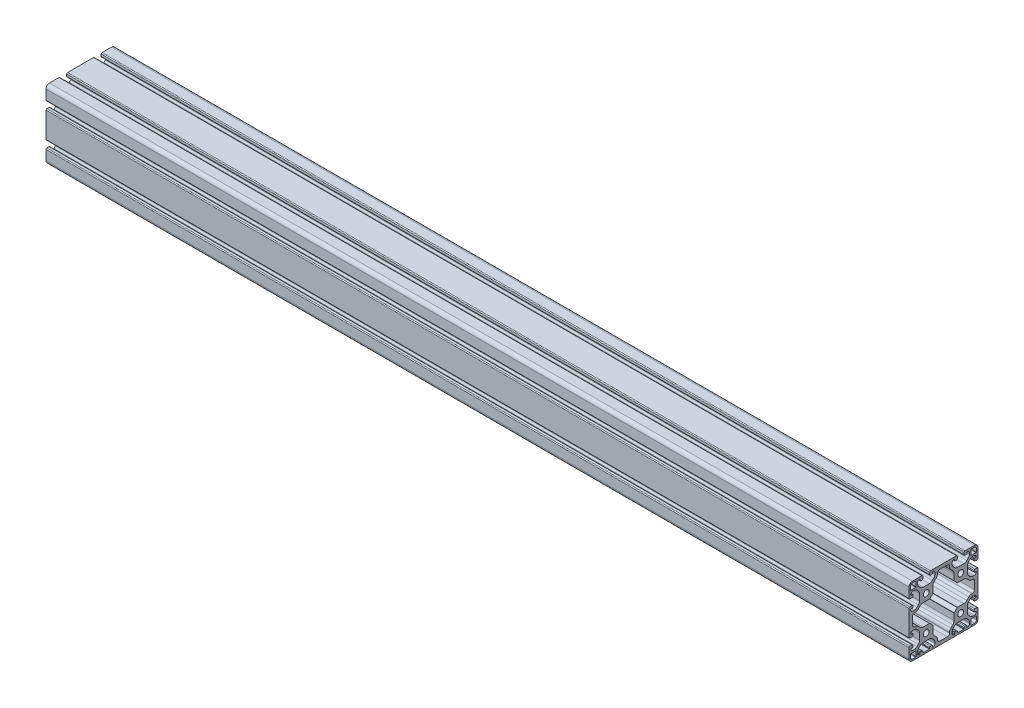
from build123d import *

# Parameters (mm, degrees)
SKIZZE14_R             = 3.4
STRUKTURBAUTEIL1_DEPTH = 1000


with BuildPart() as part:
    # Skizze14 → Strukturbauteil1 (new body)
    with BuildSketch(Plane(origin=(0, 0, 0), x_dir=(0, 0, -1), z_dir=(1, 0, 0))):
        with BuildLine():
            Line((-37.49999925, -23.673614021), (-38.99999925, -23.673614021))
            ThreePointArc((-38.99999925, -23.673614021), (-39.707106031, -23.96650724), (-39.99999925, -24.673614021))
            Line((-39.99999925, -24.673614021), (-39.99999925, -35.99999925))
            ThreePointArc((-39.99999925, -35.99999925), (-38.828426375, -38.828426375), (-35.99999925, -39.99999925))
            Line((-35.99999925, -39.99999925), (36.00000075, -39.99999925))
            ThreePointArc((36.00000075, -39.99999925), (38.828426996, -38.828424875), (39.99999925, -35.99999775))
            Line((39.99999925, -35.99999775), (39.99999925, -24.99999775))
            ThreePointArc((39.99999925, -24.99999775), (39.707106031, -24.292890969), (38.99999925, -23.99999775))
            Line((38.99999925, -23.99999775), (36.49999925, -23.99999775))
            ThreePointArc((36.49999925, -23.99999775), (35.792892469, -24.292890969), (35.49999925, -24.99999775))
            Line((35.49999925, -24.99999775), (35.49999925, -26.49999775))
            ThreePointArc((35.49999925, -26.49999775), (35.646445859, -26.853551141), (35.99999925, -26.99999775))
            Line((35.99999925, -26.99999775), (37.55000225, -26.99999775))
            ThreePointArc((37.55000225, -26.99999775), (37.868198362, -27.131800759), (37.99999925, -27.44999775))
            Line((37.99999925, -27.44999775), (37.99999925, -27.49999775))
            ThreePointArc((37.99999925, -27.49999775), (37.267766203, -29.267764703), (35.49999925, -29.99999775))
            Line((35.49999925, -29.99999775), (34.19238925, -29.99999775))
            ThreePointArc((34.19238925, -29.99999775), (32.278970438, -29.619396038), (30.65685225, -28.53553175))
            Line((30.65685225, -28.53553175), (29.21446125, -27.09314275))
            ThreePointArc((29.21446125, -27.09314275), (28.130599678, -25.471025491), (27.74999925, -23.55760875))
            Line((27.74999925, -23.55760875), (27.74999925, -16.44238675))
            ThreePointArc((27.74999925, -16.44238675), (28.130603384, -14.528969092), (29.21446925, -12.90685275))
            Line((29.21446925, -12.90685275), (30.65685225, -11.46446375))
            ThreePointArc((30.65685225, -11.46446375), (32.278970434, -10.380599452), (34.19238925, -9.99999775))
            Line((34.19238925, -9.99999775), (35.49999925, -9.99999775))
            ThreePointArc((35.49999925, -9.99999775), (37.267766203, -10.732230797), (37.99999925, -12.49999775))
            Line((37.99999925, -12.49999775), (37.99999925, -12.54999675))
            ThreePointArc((37.99999925, -12.54999675), (37.868198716, -12.868194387), (37.55000225, -12.99999775))
            Line((37.55000225, -12.99999775), (35.99999925, -12.99999775))
            ThreePointArc((35.99999925, -12.99999775), (35.646445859, -13.146444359), (35.49999925, -13.49999775))
            Line((35.49999925, -13.49999775), (35.49999925, -14.99999775))
            ThreePointArc((35.49999925, -14.99999775), (35.792892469, -15.707104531), (36.49999925, -15.99999775))
            Line((36.49999925, -15.99999775), (38.99999925, -15.99999775))
            ThreePointArc((38.99999925, -15.99999775), (39.707106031, -15.707104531), (39.99999925, -14.99999775))
            Line((39.99999925, -14.99999775), (39.99999925, 15.00000225))
            ThreePointArc((39.99999925, 15.00000225), (39.707106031, 15.707109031), (38.99999925, 16.00000225))
            Line((38.99999925, 16.00000225), (36.49999925, 16.00000225))
            ThreePointArc((36.49999925, 16.00000225), (35.792892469, 15.707109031), (35.49999925, 15.00000225))
            Line((35.49999925, 15.00000225), (35.49999925, 13.50000225))
            ThreePointArc((35.49999925, 13.50000225), (35.646445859, 13.146448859), (35.99999925, 13.00000225))
            Line((35.99999925, 13.00000225), (37.55000225, 13.00000225))
            ThreePointArc((37.55000225, 13.00000225), (37.868198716, 12.868198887), (37.99999925, 12.55000125))
            Line((37.99999925, 12.55000125), (37.99999925, 12.50000225))
            ThreePointArc((37.99999925, 12.50000225), (37.267766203, 10.732235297), (35.49999925, 10.00000225))
            Line((35.49999925, 10.00000225), (34.19238925, 10.00000225))
            ThreePointArc((34.19238925, 10.00000225), (32.278970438, 10.380603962), (30.65685225, 11.46446825))
            Line((30.65685225, 11.46446825), (29.21446125, 12.90685525))
            ThreePointArc((29.21446125, 12.90685525), (28.130599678, 14.528972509), (27.74999925, 16.44238925))
            Line((27.74999925, 16.44238925), (27.74999925, 23.55761525))
            ThreePointArc((27.74999925, 23.55761525), (28.130603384, 25.471032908), (29.21446925, 27.09314925))
            Line((29.21446925, 27.09314925), (30.65685225, 28.53554025))
            ThreePointArc((30.65685225, 28.53554025), (32.278970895, 29.619402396), (34.19238925, 30.00000225))
            Line((34.19238925, 30.00000225), (35.49999925, 30.00000225))
            ThreePointArc((35.49999925, 30.00000225), (37.267766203, 29.267769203), (37.99999925, 27.50000225))
            Line((37.99999925, 27.50000225), (37.99999925, 27.44999925))
            ThreePointArc((37.99999925, 27.44999925), (37.868197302, 27.131804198), (37.55000225, 27.00000225))
            Line((37.55000225, 27.00000225), (35.99999925, 27.00000225))
            ThreePointArc((35.99999925, 27.00000225), (35.646445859, 26.853555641), (35.49999925, 26.50000225))
            Line((35.49999925, 26.50000225), (35.49999925, 25.00000225))
            ThreePointArc((35.49999925, 25.00000225), (35.792892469, 24.292895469), (36.49999925, 24.00000225))
            Line((36.49999925, 24.00000225), (38.99999925, 24.00000225))
            ThreePointArc((38.99999925, 24.00000225), (39.70710691, 24.292893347), (40.00000225, 24.99999925))
            Line((40.00000225, 24.99999925), (40.00000225, 35.99999925))
            ThreePointArc((40.00000225, 35.99999925), (38.828428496, 38.828425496), (36.00000225, 39.99999925))
            Line((36.00000225, 39.99999925), (25.00000225, 39.99999925))
            ThreePointArc((25.00000225, 39.99999925), (24.292895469, 39.707106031), (24.00000225, 38.99999925))
            Line((24.00000225, 38.99999925), (24.00000225, 36.49999925))
            ThreePointArc((24.00000225, 36.49999925), (24.292895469, 35.792892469), (25.00000225, 35.49999925))
            Line((25.00000225, 35.49999925), (26.50000225, 35.49999925))
            ThreePointArc((26.50000225, 35.49999925), (26.853555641, 35.646445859), (27.00000225, 35.99999925))
            Line((27.00000225, 35.99999925), (27.00000225, 37.55000225))
            ThreePointArc((27.00000225, 37.55000225), (27.131804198, 37.868197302), (27.44999925, 37.99999925))
            Line((27.44999925, 37.99999925), (27.50000225, 37.99999925))
            ThreePointArc((27.50000225, 37.99999925), (29.267769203, 37.267766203), (30.00000225, 35.49999925))
            Line((30.00000225, 35.49999925), (30.00000225, 34.19238925))
            ThreePointArc((30.00000225, 34.19238925), (29.619402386, 32.278970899), (28.53554025, 30.65685225))
            Line((28.53554025, 30.65685225), (27.09314925, 29.21446125))
            ThreePointArc((27.09314925, 29.21446125), (25.471031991, 28.130599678), (23.55761525, 27.74999925))
            Line((23.55761525, 27.74999925), (16.44238925, 27.74999925))
            ThreePointArc((16.44238925, 27.74999925), (14.528971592, 28.130603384), (12.90685525, 29.21446925))
            Line((12.90685525, 29.21446925), (11.46446825, 30.65685225))
            ThreePointArc((11.46446825, 30.65685225), (10.380603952, 32.278970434), (10.00000225, 34.19238925))
            Line((10.00000225, 34.19238925), (10.00000225, 35.49999925))
            ThreePointArc((10.00000225, 35.49999925), (10.732235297, 37.267766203), (12.50000225, 37.99999925))
            Line((12.50000225, 37.99999925), (12.55000125, 37.99999925))
            ThreePointArc((12.55000125, 37.99999925), (12.868198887, 37.868198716), (13.00000225, 37.55000225))
            Line((13.00000225, 37.55000225), (13.00000225, 35.99999925))
            ThreePointArc((13.00000225, 35.99999925), (13.146448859, 35.646445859), (13.50000225, 35.49999925))
            Line((13.50000225, 35.49999925), (15.00000225, 35.49999925))
            ThreePointArc((15.00000225, 35.49999925), (15.707109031, 35.792892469), (16.00000225, 36.49999925))
            Line((16.00000225, 36.49999925), (16.00000225, 38.99999925))
            ThreePointArc((16.00000225, 38.99999925), (15.707109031, 39.707106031), (15.00000225, 39.99999925))
            Line((15.00000225, 39.99999925), (-14.99999775, 39.99999925))
            ThreePointArc((-14.99999775, 39.99999925), (-15.707104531, 39.707106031), (-15.99999775, 38.99999925))
            Line((-15.99999775, 38.99999925), (-15.99999775, 36.49999925))
            ThreePointArc((-15.99999775, 36.49999925), (-15.707104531, 35.792892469), (-14.99999775, 35.49999925))
            Line((-14.99999775, 35.49999925), (-13.49999775, 35.49999925))
            ThreePointArc((-13.49999775, 35.49999925), (-13.146444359, 35.646445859), (-12.99999775, 35.99999925))
            Line((-12.99999775, 35.99999925), (-12.99999775, 37.55000225))
            ThreePointArc((-12.99999775, 37.55000225), (-12.868194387, 37.868198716), (-12.54999675, 37.99999925))
            Line((-12.54999675, 37.99999925), (-12.49999775, 37.99999925))
            ThreePointArc((-12.49999775, 37.99999925), (-10.732230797, 37.267766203), (-9.99999775, 35.49999925))
            Line((-9.99999775, 35.49999925), (-9.99999775, 34.19238925))
            ThreePointArc((-9.99999775, 34.19238925), (-10.380599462, 32.278970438), (-11.46446375, 30.65685225))
            Line((-11.46446375, 30.65685225), (-12.90685275, 29.21446125))
            ThreePointArc((-12.90685275, 29.21446125), (-14.528970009, 28.130599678), (-16.44238675, 27.74999925))
            Line((-16.44238675, 27.74999925), (-23.55760875, 27.74999925))
            ThreePointArc((-23.55760875, 27.74999925), (-25.471026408, 28.130603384), (-27.09314275, 29.21446925))
            Line((-27.09314275, 29.21446925), (-28.53553175, 30.65685225))
            ThreePointArc((-28.53553175, 30.65685225), (-29.619396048, 32.278970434), (-29.99999775, 34.19238925))
            Line((-29.99999775, 34.19238925), (-29.99999775, 35.49999925))
            ThreePointArc((-29.99999775, 35.49999925), (-29.267764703, 37.267766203), (-27.49999775, 37.99999925))
            Line((-27.49999775, 37.99999925), (-27.44999775, 37.99999925))
            ThreePointArc((-27.44999775, 37.99999925), (-27.131800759, 37.868198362), (-26.99999775, 37.55000225))
            Line((-26.99999775, 37.55000225), (-26.99999775, 35.99999925))
            ThreePointArc((-26.99999775, 35.99999925), (-26.853551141, 35.646445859), (-26.49999775, 35.49999925))
            Line((-26.49999775, 35.49999925), (-24.99999775, 35.49999925))
            ThreePointArc((-24.99999775, 35.49999925), (-24.292890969, 35.792892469), (-23.99999775, 36.49999925))
            Line((-23.99999775, 36.49999925), (-23.99999775, 38.99999925))
            ThreePointArc((-23.99999775, 38.99999925), (-24.292890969, 39.707106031), (-24.99999775, 39.99999925))
            Line((-24.99999775, 39.99999925), (-35.99999775, 39.99999925))
            ThreePointArc((-35.99999775, 39.99999925), (-38.828424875, 38.828426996), (-39.99999925, 36.00000075))
            Line((-39.99999925, 36.00000075), (-39.99999925, 24.765242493))
            ThreePointArc((-39.99999925, 24.765242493), (-39.707106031, 24.058135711), (-38.99999925, 23.765242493))
            Line((-38.99999925, 23.765242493), (-37.49999925, 23.765242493))
            Line((-37.49999925, 23.765242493), (-36.49999925, 23.765242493))
            ThreePointArc((-36.49999925, 23.765242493), (-35.792892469, 24.058135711), (-35.49999925, 24.765242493))
            Line((-35.49999925, 24.765242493), (-35.49999925, 26.265242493))
            ThreePointArc((-35.49999925, 26.265242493), (-35.646445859, 26.618795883), (-35.99999925, 26.765242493))
            Line((-35.99999925, 26.765242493), (-37.49999925, 26.765242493))
            ThreePointArc((-37.49999925, 26.765242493), (-37.853552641, 26.911689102), (-37.99999925, 27.265242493))
            ThreePointArc((-37.99999925, 27.265242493), (-37.267766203, 29.033009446), (-35.49999925, 29.765242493))
            Line((-35.49999925, 29.765242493), (-34.19238725, 29.765242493))
            ThreePointArc((-34.19238725, 29.765242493), (-32.278971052, 29.384641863), (-30.65685425, 28.300780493))
            Line((-30.65685425, 28.300780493), (-29.21446525, 26.858389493))
            ThreePointArc((-29.21446525, 26.858389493), (-28.130601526, 25.236272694), (-27.74999925, 23.322855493))
            Line((-27.74999925, 23.322855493), (-27.74999925, 16.207629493))
            ThreePointArc((-27.74999925, 16.207629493), (-28.130601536, 14.294212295), (-29.21446525, 12.672095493))
            Line((-29.21446525, 12.672095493), (-30.65685425, 11.229708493))
            ThreePointArc((-30.65685425, 11.229708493), (-32.278970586, 10.14584496), (-34.19238725, 9.765242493))
            Line((-34.19238725, 9.765242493), (-35.49999925, 9.765242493))
            ThreePointArc((-35.49999925, 9.765242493), (-37.267766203, 10.49747554), (-37.99999925, 12.265242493))
            ThreePointArc((-37.99999925, 12.265242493), (-37.853552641, 12.618795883), (-37.49999925, 12.765242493))
            Line((-37.49999925, 12.765242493), (-35.99999925, 12.765242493))
            ThreePointArc((-35.99999925, 12.765242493), (-35.646445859, 12.911689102), (-35.49999925, 13.265242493))
            Line((-35.49999925, 13.265242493), (-35.49999925, 14.765242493))
            ThreePointArc((-35.49999925, 14.765242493), (-35.792892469, 15.472349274), (-36.49999925, 15.765242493))
            Line((-36.49999925, 15.765242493), (-37.49999925, 15.765242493))
            Line((-37.49999925, 15.765242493), (-38.99999925, 15.765242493))
            ThreePointArc((-38.99999925, 15.765242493), (-39.707106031, 15.472349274), (-39.99999925, 14.765242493))
            Line((-39.99999925, 14.765242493), (-39.99999925, -14.673614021))
            ThreePointArc((-39.99999925, -14.673614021), (-39.707106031, -15.380720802), (-38.99999925, -15.673614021))
            Line((-38.99999925, -15.673614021), (-37.49999925, -15.673614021))
            Line((-37.49999925, -15.673614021), (-36.49999925, -15.673614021))
            ThreePointArc((-36.49999925, -15.673614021), (-35.792892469, -15.380720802), (-35.49999925, -14.673614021))
            Line((-35.49999925, -14.673614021), (-35.49999925, -13.173614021))
            ThreePointArc((-35.49999925, -13.173614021), (-35.646445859, -12.820060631), (-35.99999925, -12.673614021))
            Line((-35.99999925, -12.673614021), (-37.49999925, -12.673614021))
            ThreePointArc((-37.49999925, -12.673614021), (-37.853552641, -12.527167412), (-37.99999925, -12.173614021))
            ThreePointArc((-37.99999925, -12.173614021), (-37.267766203, -10.405847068), (-35.49999925, -9.673614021))
            Line((-35.49999925, -9.673614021), (-34.19238725, -9.673614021))
            ThreePointArc((-34.19238725, -9.673614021), (-32.278970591, -10.054216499), (-30.65685425, -11.138080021))
            Line((-30.65685425, -11.138080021), (-29.21446525, -12.580469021))
            ThreePointArc((-29.21446525, -12.580469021), (-28.130601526, -14.20258582), (-27.74999925, -16.116003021))
            Line((-27.74999925, -16.116003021), (-27.74999925, -23.231225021))
            ThreePointArc((-27.74999925, -23.231225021), (-28.130601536, -25.144642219), (-29.21446525, -26.766759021))
            Line((-29.21446525, -26.766759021), (-30.65685425, -28.209148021))
            ThreePointArc((-30.65685425, -28.209148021), (-32.278970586, -29.293011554), (-34.19238725, -29.673614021))
            Line((-34.19238725, -29.673614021), (-35.49999925, -29.673614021))
            ThreePointArc((-35.49999925, -29.673614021), (-37.267766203, -28.941380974), (-37.99999925, -27.173614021))
            ThreePointArc((-37.99999925, -27.173614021), (-37.853552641, -26.820060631), (-37.49999925, -26.673614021))
            Line((-37.49999925, -26.673614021), (-35.99999925, -26.673614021))
            ThreePointArc((-35.99999925, -26.673614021), (-35.646445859, -26.527167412), (-35.49999925, -26.173614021))
            Line((-35.49999925, -26.173614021), (-35.49999925, -24.673614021))
            ThreePointArc((-35.49999925, -24.673614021), (-35.792892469, -23.96650724), (-36.49999925, -23.673614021))
            Line((-36.49999925, -23.673614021), (-37.49999925, -23.673614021))
        make_face()
        with Locations((20.00000075, 20.00000075)):
            Circle(SKIZZE14_R, mode=Mode.SUBTRACT)
        with Locations((-19.99999925, 20.00000075)):
            Circle(SKIZZE14_R, mode=Mode.SUBTRACT)
        with Locations((-19.99999925, -19.99999925)):
            Circle(SKIZZE14_R, mode=Mode.SUBTRACT)
        with Locations((20.00000075, -19.99999925)):
            Circle(SKIZZE14_R, mode=Mode.SUBTRACT)
        with BuildLine():
            Line((-38.19999775, 36.00000075), (-38.19999775, 32.30000375))
            ThreePointArc((-38.19999775, 32.30000375), (-38.053551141, 31.946450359), (-37.69999775, 31.80000375))
            Line((-37.69999775, 31.80000375), (-32.29999775, 31.80000375))
            ThreePointArc((-32.29999775, 31.80000375), (-31.946444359, 31.946450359), (-31.79999775, 32.30000375))
            Line((-31.79999775, 32.30000375), (-31.79999775, 37.69999775))
            ThreePointArc((-31.79999775, 37.69999775), (-31.946444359, 38.053551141), (-32.29999775, 38.19999775))
            Line((-32.29999775, 38.19999775), (-35.99999775, 38.19999775))
            ThreePointArc((-35.99999775, 38.19999775), (-37.555631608, 37.555633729), (-38.19999775, 36.00000075))
        make_face(mode=Mode.SUBTRACT)
        with BuildLine():
            Line((-32.94974725, 7.00000075), (-33.49999925, 7.00000075))
            ThreePointArc((-33.49999925, 7.00000075), (-35.267766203, 6.267767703), (-35.99999925, 4.50000075))
            Line((-35.99999925, 4.50000075), (-35.99999925, -4.49999925))
            ThreePointArc((-35.99999925, -4.49999925), (-35.266966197, -6.266966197), (-33.49999925, -6.99999925))
            Line((-33.49999925, -6.99999925), (-32.94974725, -6.99999925))
            ThreePointArc((-32.94974725, -6.99999925), (-31.036329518, -7.380601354), (-29.41421225, -8.46446525))
            Line((-29.41421225, -8.46446525), (-27.09314425, -10.78553325))
            ThreePointArc((-27.09314425, -10.78553325), (-25.471027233, -11.869396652), (-23.557609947, -12.249998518))
            Line((-23.557609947, -12.249998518), (-16.241377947, -12.249998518))
            ThreePointArc((-16.241377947, -12.249998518), (-16.050035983, -12.288058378), (-15.887823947, -12.396444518))
            Line((-15.887823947, -12.396444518), (-12.396444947, -15.887823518))
            ThreePointArc((-12.396444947, -15.887823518), (-12.288058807, -16.050035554), (-12.249998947, -16.241377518))
            Line((-12.249998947, -16.241377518), (-12.249998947, -23.557609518))
            ThreePointArc((-12.249998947, -23.557609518), (-11.869396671, -25.471026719), (-10.785532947, -27.093143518))
            Line((-10.785532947, -27.093143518), (-8.464464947, -29.414211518))
            ThreePointArc((-8.464464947, -29.414211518), (-7.380601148, -31.036328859), (-6.999999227, -32.949746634))
            Line((-6.999999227, -32.949746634), (-6.999999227, -33.499998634))
            ThreePointArc((-6.999999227, -33.499998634), (-6.26776618, -35.267765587), (-4.499999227, -35.999998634))
            Line((-4.499999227, -35.999998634), (4.500000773, -35.999998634))
            ThreePointArc((4.500000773, -35.999998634), (6.267767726, -35.267765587), (7.000000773, -33.499998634))
            Line((7.000000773, -33.499998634), (7.000000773, -32.949746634))
            ThreePointArc((7.000000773, -32.949746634), (7.380602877, -31.036328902), (8.464466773, -29.414211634))
            Line((8.464466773, -29.414211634), (10.785534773, -27.093143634))
            ThreePointArc((10.785534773, -27.093143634), (11.869398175, -25.471026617), (12.250000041, -23.557609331))
            Line((12.250000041, -23.557609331), (12.250000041, -16.241377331))
            ThreePointArc((12.250000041, -16.241377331), (12.288059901, -16.050035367), (12.396446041, -15.887823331))
            Line((12.396446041, -15.887823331), (15.887825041, -12.396444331))
            ThreePointArc((15.887825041, -12.396444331), (16.050037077, -12.288058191), (16.241379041, -12.249998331))
            Line((16.241379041, -12.249998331), (23.557613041, -12.249998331))
            ThreePointArc((23.557613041, -12.249998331), (25.471030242, -11.869396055), (27.093147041, -10.785532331))
            Line((27.093147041, -10.785532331), (29.414215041, -8.464464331))
            ThreePointArc((29.414215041, -8.464464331), (31.03633042, -7.380601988), (32.949745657, -6.999999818))
            Line((32.949745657, -6.999999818), (33.500000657, -6.999999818))
            ThreePointArc((33.500000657, -6.999999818), (35.26776761, -6.267766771), (36.000000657, -4.499999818))
            Line((36.000000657, -4.499999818), (36.000000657, 4.500000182))
            ThreePointArc((36.000000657, 4.500000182), (35.267766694, 6.267766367), (33.49999975, 6.999998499))
            Line((33.49999975, 6.999998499), (32.94974475, 6.999998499))
            ThreePointArc((32.94974475, 6.999998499), (31.036329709, 7.380601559), (29.41421475, 8.464464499))
            Line((29.41421475, 8.464464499), (27.09314675, 10.785532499))
            ThreePointArc((27.09314675, 10.785532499), (25.471030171, 11.86939634), (23.557613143, 12.249998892))
            Line((23.557613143, 12.249998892), (16.241379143, 12.249998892))
            ThreePointArc((16.241379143, 12.249998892), (16.05003718, 12.288058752), (15.887825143, 12.396444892))
            Line((15.887825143, 12.396444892), (12.396446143, 15.887823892))
            ThreePointArc((12.396446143, 15.887823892), (12.288060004, 16.050035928), (12.250000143, 16.241377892))
            Line((12.250000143, 16.241377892), (12.250000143, 23.557611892))
            ThreePointArc((12.250000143, 23.557611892), (11.869397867, 25.471029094), (10.785534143, 27.093145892))
            Line((10.785534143, 27.093145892), (8.464466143, 29.414213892))
            ThreePointArc((8.464466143, 29.414213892), (7.380603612, 31.036329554), (7.000001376, 32.949745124))
            Line((7.000001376, 32.949745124), (7.000001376, 33.500000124))
            ThreePointArc((7.000001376, 33.500000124), (6.267768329, 35.267767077), (4.500001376, 36.000000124))
            Line((4.500001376, 36.000000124), (-4.499998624, 36.000000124))
            ThreePointArc((-4.499998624, 36.000000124), (-6.267765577, 35.267767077), (-6.999998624, 33.500000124))
            Line((-6.999998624, 33.500000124), (-6.999998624, 32.949745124))
            ThreePointArc((-6.999998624, 32.949745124), (-7.380601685, 31.036330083), (-8.464464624, 29.414215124))
            Line((-8.464464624, 29.414215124), (-10.785532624, 27.093147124))
            ThreePointArc((-10.785532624, 27.093147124), (-11.869396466, 25.471030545), (-12.249999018, 23.557613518))
            Line((-12.249999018, 23.557613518), (-12.249999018, 16.241379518))
            ThreePointArc((-12.249999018, 16.241379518), (-12.288058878, 16.050037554), (-12.396445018, 15.887825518))
            Line((-12.396445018, 15.887825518), (-15.887824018, 12.396446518))
            ThreePointArc((-15.887824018, 12.396446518), (-16.050036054, 12.288060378), (-16.241378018, 12.250000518))
            Line((-16.241378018, 12.250000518), (-23.557610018, 12.250000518))
            ThreePointArc((-23.557610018, 12.250000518), (-25.471027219, 11.869398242), (-27.093144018, 10.785534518))
            Line((-27.093144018, 10.785534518), (-29.414212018, 8.464466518))
            ThreePointArc((-29.414212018, 8.464466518), (-31.036329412, 7.380602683), (-32.94974725, 7.00000075))
        make_face(mode=Mode.SUBTRACT)
        with BuildLine():
            Line((-32.29999925, -31.79999925), (-37.69999925, -31.79999925))
            ThreePointArc((-37.69999925, -31.79999925), (-38.053552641, -31.946445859), (-38.19999925, -32.29999925))
            Line((-38.19999925, -32.29999925), (-38.19999925, -35.99999925))
            ThreePointArc((-38.19999925, -35.99999925), (-37.555634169, -37.555634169), (-35.99999925, -38.19999925))
            Line((-35.99999925, -38.19999925), (-32.29999925, -38.19999925))
            ThreePointArc((-32.29999925, -38.19999925), (-31.946445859, -38.053552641), (-31.79999925, -37.69999925))
            Line((-31.79999925, -37.69999925), (-31.79999925, -32.29999925))
            ThreePointArc((-31.79999925, -32.29999925), (-31.946445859, -31.946445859), (-32.29999925, -31.79999925))
        make_face(mode=Mode.SUBTRACT)
        with BuildLine():
            Line((31.80000375, -32.29999775), (31.80000375, -37.69999775))
            ThreePointArc((31.80000375, -37.69999775), (31.946450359, -38.053551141), (32.30000375, -38.19999775))
            Line((32.30000375, -38.19999775), (36.00000075, -38.19999775))
            ThreePointArc((36.00000075, -38.19999775), (37.555633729, -37.555631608), (38.19999775, -35.99999775))
            Line((38.19999775, -35.99999775), (38.19999775, -32.29999775))
            ThreePointArc((38.19999775, -32.29999775), (38.053551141, -31.946444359), (37.69999775, -31.79999775))
            Line((37.69999775, -31.79999775), (32.30000375, -31.79999775))
            ThreePointArc((32.30000375, -31.79999775), (31.946450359, -31.946444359), (31.80000375, -32.29999775))
        make_face(mode=Mode.SUBTRACT)
        with BuildLine():
            Line((10.00000075, -34.19238725), (10.00000075, -35.49999925))
            ThreePointArc((10.00000075, -35.49999925), (10.732233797, -37.267766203), (12.50000075, -37.99999925))
            ThreePointArc((12.50000075, -37.99999925), (12.853554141, -37.853552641), (13.00000075, -37.49999925))
            Line((13.00000075, -37.49999925), (13.00000075, -35.99999925))
            ThreePointArc((13.00000075, -35.99999925), (13.146447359, -35.646445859), (13.50000075, -35.49999925))
            Line((13.50000075, -35.49999925), (15.00000075, -35.49999925))
            ThreePointArc((15.00000075, -35.49999925), (15.707107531, -35.792892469), (16.00000075, -36.49999925))
            Line((16.00000075, -36.49999925), (16.00000075, -37.49999925))
            ThreePointArc((16.00000075, -37.49999925), (16.146447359, -37.853552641), (16.50000075, -37.99999925))
            Line((16.50000075, -37.99999925), (23.50000075, -37.99999925))
            ThreePointArc((23.50000075, -37.99999925), (23.853554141, -37.853552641), (24.00000075, -37.49999925))
            Line((24.00000075, -37.49999925), (24.00000075, -36.49999925))
            ThreePointArc((24.00000075, -36.49999925), (24.292893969, -35.792892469), (25.00000075, -35.49999925))
            Line((25.00000075, -35.49999925), (26.50000075, -35.49999925))
            ThreePointArc((26.50000075, -35.49999925), (26.853554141, -35.646445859), (27.00000075, -35.99999925))
            Line((27.00000075, -35.99999925), (27.00000075, -37.49999925))
            ThreePointArc((27.00000075, -37.49999925), (27.146447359, -37.853552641), (27.50000075, -37.99999925))
            ThreePointArc((27.50000075, -37.99999925), (29.267767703, -37.267766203), (30.00000075, -35.49999925))
            Line((30.00000075, -35.49999925), (30.00000075, -34.19238725))
            ThreePointArc((30.00000075, -34.19238725), (29.61940013, -32.278971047), (28.53553875, -30.65685425))
            Line((28.53553875, -30.65685425), (27.09314775, -29.21446525))
            ThreePointArc((27.09314775, -29.21446525), (25.471030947, -28.130601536), (23.55761375, -27.74999925))
            Line((23.55761375, -27.74999925), (16.44238775, -27.74999925))
            ThreePointArc((16.44238775, -27.74999925), (14.528970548, -28.130601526), (12.90685375, -29.21446525))
            Line((12.90685375, -29.21446525), (11.46446675, -30.65685425))
            ThreePointArc((11.46446675, -30.65685425), (10.380603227, -32.278970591), (10.00000075, -34.19238725))
        make_face(mode=Mode.SUBTRACT)
        with BuildLine():
            Line((-29.99999925, -34.19238725), (-29.99999925, -35.49999925))
            ThreePointArc((-29.99999925, -35.49999925), (-29.267766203, -37.267766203), (-27.49999925, -37.99999925))
            ThreePointArc((-27.49999925, -37.99999925), (-27.146445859, -37.853552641), (-26.99999925, -37.49999925))
            Line((-26.99999925, -37.49999925), (-26.99999925, -35.99999925))
            ThreePointArc((-26.99999925, -35.99999925), (-26.853552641, -35.646445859), (-26.49999925, -35.49999925))
            Line((-26.49999925, -35.49999925), (-24.99999925, -35.49999925))
            ThreePointArc((-24.99999925, -35.49999925), (-24.292892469, -35.792892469), (-23.99999925, -36.49999925))
            Line((-23.99999925, -36.49999925), (-23.99999925, -37.49999925))
            ThreePointArc((-23.99999925, -37.49999925), (-23.853552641, -37.853552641), (-23.49999925, -37.99999925))
            Line((-23.49999925, -37.99999925), (-16.49999925, -37.99999925))
            ThreePointArc((-16.49999925, -37.99999925), (-16.146445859, -37.853552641), (-15.99999925, -37.49999925))
            Line((-15.99999925, -37.49999925), (-15.99999925, -36.49999925))
            ThreePointArc((-15.99999925, -36.49999925), (-15.707106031, -35.792892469), (-14.99999925, -35.49999925))
            Line((-14.99999925, -35.49999925), (-13.49999925, -35.49999925))
            ThreePointArc((-13.49999925, -35.49999925), (-13.146445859, -35.646445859), (-12.99999925, -35.99999925))
            Line((-12.99999925, -35.99999925), (-12.99999925, -37.49999925))
            ThreePointArc((-12.99999925, -37.49999925), (-12.853552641, -37.853552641), (-12.49999925, -37.99999925))
            ThreePointArc((-12.49999925, -37.99999925), (-10.732232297, -37.267766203), (-9.99999925, -35.49999925))
            Line((-9.99999925, -35.49999925), (-9.99999925, -34.19238725))
            ThreePointArc((-9.99999925, -34.19238725), (-10.380601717, -32.278970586), (-11.46446525, -30.65685425))
            Line((-11.46446525, -30.65685425), (-12.90685425, -29.21446525))
            ThreePointArc((-12.90685425, -29.21446525), (-14.528971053, -28.130601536), (-16.44238825, -27.74999925))
            Line((-16.44238825, -27.74999925), (-23.55761025, -27.74999925))
            ThreePointArc((-23.55761025, -27.74999925), (-25.471027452, -28.130601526), (-27.09314425, -29.21446525))
            Line((-27.09314425, -29.21446525), (-28.53553325, -30.65685425))
            ThreePointArc((-28.53553325, -30.65685425), (-29.619396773, -32.278970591), (-29.99999925, -34.19238725))
        make_face(mode=Mode.SUBTRACT)
        with BuildLine():
            Line((31.80000525, 37.69999625), (31.80000525, 32.30000225))
            ThreePointArc((31.80000525, 32.30000225), (31.946451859, 31.946448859), (32.30000525, 31.80000225))
            Line((32.30000525, 31.80000225), (37.69999925, 31.80000225))
            ThreePointArc((37.69999925, 31.80000225), (38.053552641, 31.946448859), (38.19999925, 32.30000225))
            Line((38.19999925, 32.30000225), (38.19999925, 35.99999925))
            ThreePointArc((38.19999925, 35.99999925), (37.555634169, 37.555631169), (36.00000225, 38.19999625))
            Line((36.00000225, 38.19999625), (32.30000525, 38.19999625))
            ThreePointArc((32.30000525, 38.19999625), (31.946451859, 38.053549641), (31.80000525, 37.69999625))
        make_face(mode=Mode.SUBTRACT)
    extrude(amount=STRUKTURBAUTEIL1_DEPTH)


solid = part.part
